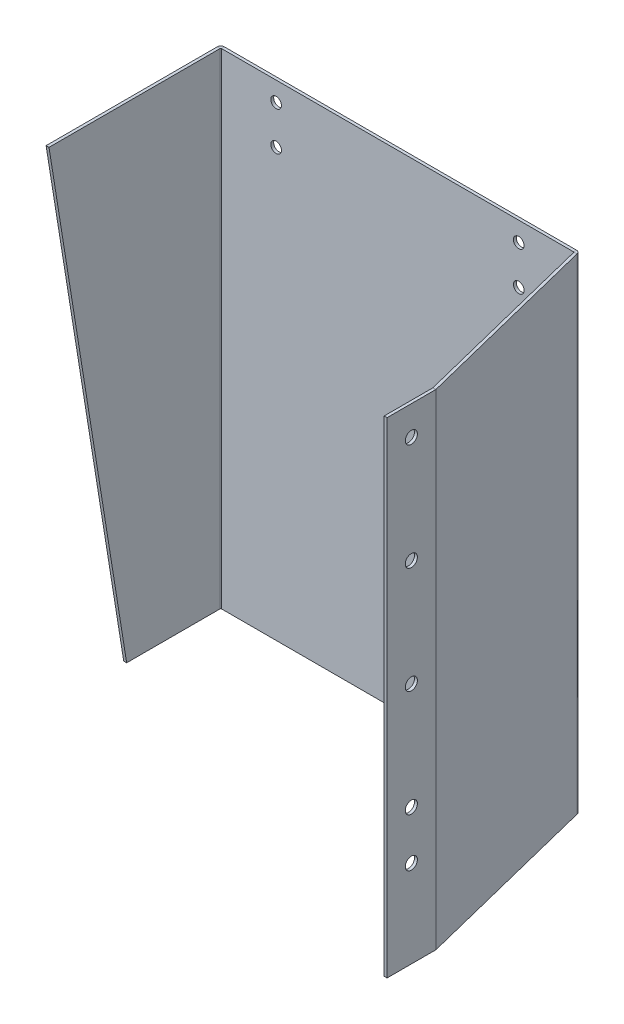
ISO-10303-21;
HEADER;
FILE_DESCRIPTION(('STEP AP214'),'2;1');
FILE_NAME('part.step','',(''),(''),'','','');
FILE_SCHEMA(('AUTOMOTIVE_DESIGN { 1 0 10303 214 1 1 1 1 }'));
ENDSEC;
DATA;
#1=APPLICATION_CONTEXT('core data for automotive mechanical design processes');
#2=APPLICATION_PROTOCOL_DEFINITION('international standard','automotive_design',2000,#1);
#3=PRODUCT_CONTEXT('',#1,'mechanical');
#4=PRODUCT('Part','Part','',(#3));
#5=PRODUCT_RELATED_PRODUCT_CATEGORY('part','',(#4));
#6=PRODUCT_DEFINITION_FORMATION('','',#4);
#7=PRODUCT_DEFINITION_CONTEXT('part definition',#1,'design');
#8=PRODUCT_DEFINITION('design','',#6,#7);
#9=PRODUCT_DEFINITION_SHAPE('','',#8);
#10=(LENGTH_UNIT() NAMED_UNIT(*) SI_UNIT(.MILLI.,.METRE.));
#11=(NAMED_UNIT(*) PLANE_ANGLE_UNIT() SI_UNIT($,.RADIAN.));
#12=(NAMED_UNIT(*) SI_UNIT($,.STERADIAN.) SOLID_ANGLE_UNIT());
#13=UNCERTAINTY_MEASURE_WITH_UNIT(LENGTH_MEASURE(1.E-05),#10,'distance_accuracy_value','');
#14=(GEOMETRIC_REPRESENTATION_CONTEXT(3) GLOBAL_UNCERTAINTY_ASSIGNED_CONTEXT((#13)) GLOBAL_UNIT_ASSIGNED_CONTEXT((#10,
#11,#12)) REPRESENTATION_CONTEXT('',''));
#15=CARTESIAN_POINT('',(0.,0.,0.));
#16=DIRECTION('',(0.,0.,1.));
#17=DIRECTION('',(1.,0.,0.));
#18=AXIS2_PLACEMENT_3D('',#15,#16,#17);
#19=CARTESIAN_POINT('',(366.910887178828,-500.,2.27423431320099));
#20=DIRECTION('',(0.,1.,0.));
#21=DIRECTION('',(-1.,0.,0.));
#22=AXIS2_PLACEMENT_3D('',#19,#20,#21);
#23=PLANE('',#22);
#24=DIRECTION('',(0.970295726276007,0.,-0.241921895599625));
#25=VECTOR('',#24,1.);
#26=CARTESIAN_POINT('',(412.362498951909,-500.,196.971388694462));
#27=LINE('',#26,#25);
#28=CARTESIAN_POINT('',(412.362498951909,-500.,196.971388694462));
#29=VERTEX_POINT('',#28);
#30=CARTESIAN_POINT('',(415.273386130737,-500.,196.245623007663));
#31=VERTEX_POINT('',#30);
#32=EDGE_CURVE('E219',#29,#31,#27,.T.);
#33=ORIENTED_EDGE('',*,*,#32,.F.);
#34=DIRECTION('',(-0.241921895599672,0.,-0.970295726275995));
#35=VECTOR('',#34,1.);
#36=CARTESIAN_POINT('',(364.,-500.,3.));
#37=LINE('',#36,#35);
#38=CARTESIAN_POINT('',(364.13922483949,-500.,3.55840033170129));
#39=VERTEX_POINT('',#38);
#40=EDGE_CURVE('E235',#29,#39,#37,.T.);
#41=ORIENTED_EDGE('',*,*,#40,.T.);
#42=DIRECTION('',(0.970295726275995,0.,-0.241921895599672));
#43=VECTOR('',#42,1.);
#44=CARTESIAN_POINT('',(364.13922483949,-500.,3.55840033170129));
#45=LINE('',#44,#43);
#46=CARTESIAN_POINT('',(367.050112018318,-500.,2.83263464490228));
#47=VERTEX_POINT('',#46);
#48=EDGE_CURVE('E222',#39,#47,#45,.T.);
#49=ORIENTED_EDGE('',*,*,#48,.T.);
#50=DIRECTION('',(-0.241921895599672,0.,-0.970295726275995));
#51=VECTOR('',#50,1.);
#52=CARTESIAN_POINT('',(366.910887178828,-500.,2.27423431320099));
#53=LINE('',#52,#51);
#54=EDGE_CURVE('E239',#31,#47,#53,.T.);
#55=ORIENTED_EDGE('',*,*,#54,.F.);
#56=EDGE_LOOP('',(#33,#41,#49,#55));
#57=FACE_BOUND('',#56,.T.);
#58=ADVANCED_FACE('F43',(#57),#23,.F.);
#59=CARTESIAN_POINT('',(415.295266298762,0.,196.3333795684));
#60=DIRECTION('',(0.,-1.,0.));
#61=DIRECTION('',(0.,0.,-1.));
#62=AXIS2_PLACEMENT_3D('',#59,#60,#61);
#63=PLANE('',#62);
#64=DIRECTION('',(0.970295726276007,0.,-0.241921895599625));
#65=VECTOR('',#64,1.);
#66=CARTESIAN_POINT('',(412.362498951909,0.,196.971388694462));
#67=LINE('',#66,#65);
#68=CARTESIAN_POINT('',(412.362498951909,0.,196.971388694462));
#69=VERTEX_POINT('',#68);
#70=CARTESIAN_POINT('',(415.273386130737,0.,196.245623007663));
#71=VERTEX_POINT('',#70);
#72=EDGE_CURVE('E217',#69,#71,#67,.T.);
#73=ORIENTED_EDGE('',*,*,#72,.T.);
#74=DIRECTION('',(0.241921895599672,0.,0.970295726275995));
#75=VECTOR('',#74,1.);
#76=CARTESIAN_POINT('',(415.295266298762,0.,196.3333795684));
#77=LINE('',#76,#75);
#78=CARTESIAN_POINT('',(367.050112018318,0.,2.83263464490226));
#79=VERTEX_POINT('',#78);
#80=EDGE_CURVE('E241',#79,#71,#77,.T.);
#81=ORIENTED_EDGE('',*,*,#80,.F.);
#82=DIRECTION('',(0.970295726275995,0.,-0.241921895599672));
#83=VECTOR('',#82,1.);
#84=CARTESIAN_POINT('',(364.13922483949,0.,3.55840033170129));
#85=LINE('',#84,#83);
#86=CARTESIAN_POINT('',(364.13922483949,0.,3.55840033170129));
#87=VERTEX_POINT('',#86);
#88=EDGE_CURVE('E227',#87,#79,#85,.T.);
#89=ORIENTED_EDGE('',*,*,#88,.F.);
#90=DIRECTION('',(0.241921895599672,0.,0.970295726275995));
#91=VECTOR('',#90,1.);
#92=CARTESIAN_POINT('',(412.384379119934,0.,197.059145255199));
#93=LINE('',#92,#91);
#94=EDGE_CURVE('E237',#87,#69,#93,.T.);
#95=ORIENTED_EDGE('',*,*,#94,.T.);
#96=EDGE_LOOP('',(#73,#81,#89,#95));
#97=FACE_BOUND('',#96,.T.);
#98=ADVANCED_FACE('F375',(#97),#63,.F.);
#99=CARTESIAN_POINT('',(415.295266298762,-500.,196.3333795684));
#100=DIRECTION('',(-0.970295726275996,0.,0.241921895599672));
#101=DIRECTION('',(0.241921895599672,0.,0.970295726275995));
#102=AXIS2_PLACEMENT_3D('',#99,#100,#101);
#103=PLANE('',#102);
#104=DIRECTION('',(0.,1.,0.));
#105=VECTOR('',#104,1.);
#106=CARTESIAN_POINT('',(415.273386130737,0.,196.245623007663));
#107=LINE('',#106,#105);
#108=EDGE_CURVE('E167',#71,#31,#107,.F.);
#109=ORIENTED_EDGE('',*,*,#108,.T.);
#110=ORIENTED_EDGE('',*,*,#54,.T.);
#111=DIRECTION('',(0.,-1.,0.));
#112=VECTOR('',#111,1.);
#113=CARTESIAN_POINT('',(367.050112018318,-500.,2.8326346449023));
#114=LINE('',#113,#112);
#115=EDGE_CURVE('E230',#79,#47,#114,.T.);
#116=ORIENTED_EDGE('',*,*,#115,.F.);
#117=ORIENTED_EDGE('',*,*,#80,.T.);
#118=EDGE_LOOP('',(#109,#110,#116,#117));
#119=FACE_BOUND('',#118,.T.);
#120=ADVANCED_FACE('F382',(#119),#103,.F.);
#121=CARTESIAN_POINT('',(412.384379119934,-500.,197.059145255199));
#122=DIRECTION('',(-0.970295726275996,0.,0.241921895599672));
#123=DIRECTION('',(0.241921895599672,0.,0.970295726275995));
#124=AXIS2_PLACEMENT_3D('',#121,#122,#123);
#125=PLANE('',#124);
#126=ORIENTED_EDGE('',*,*,#40,.F.);
#127=DIRECTION('',(0.,1.,0.));
#128=VECTOR('',#127,1.);
#129=CARTESIAN_POINT('',(412.362498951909,0.,196.971388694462));
#130=LINE('',#129,#128);
#131=EDGE_CURVE('E58',#69,#29,#130,.F.);
#132=ORIENTED_EDGE('',*,*,#131,.F.);
#133=ORIENTED_EDGE('',*,*,#94,.F.);
#134=DIRECTION('',(0.,1.,0.));
#135=VECTOR('',#134,1.);
#136=CARTESIAN_POINT('',(364.13922483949,-500.,3.55840033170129));
#137=LINE('',#136,#135);
#138=EDGE_CURVE('E225',#39,#87,#137,.T.);
#139=ORIENTED_EDGE('',*,*,#138,.F.);
#140=EDGE_LOOP('',(#126,#132,#133,#139));
#141=FACE_BOUND('',#140,.T.);
#142=ADVANCED_FACE('F453',(#141),#125,.T.);
#143=CARTESIAN_POINT('',(0.,-500.,3.));
#144=DIRECTION('',(0.,1.,0.));
#145=DIRECTION('',(0.,0.,1.));
#146=AXIS2_PLACEMENT_3D('',#143,#144,#145);
#147=PLANE('',#146);
#148=DIRECTION('',(0.,0.,-1.));
#149=VECTOR('',#148,1.);
#150=CARTESIAN_POINT('',(363.424505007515,-500.,3.));
#151=LINE('',#150,#149);
#152=CARTESIAN_POINT('',(363.424505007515,-500.,3.));
#153=VERTEX_POINT('',#152);
#154=CARTESIAN_POINT('',(363.424505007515,-500.,0.));
#155=VERTEX_POINT('',#154);
#156=EDGE_CURVE('E66',#153,#155,#151,.T.);
#157=ORIENTED_EDGE('',*,*,#156,.F.);
#158=DIRECTION('',(1.,0.,0.));
#159=VECTOR('',#158,1.);
#160=CARTESIAN_POINT('',(0.,-500.,3.));
#161=LINE('',#160,#159);
#162=CARTESIAN_POINT('',(0.736600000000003,-500.,3.));
#163=VERTEX_POINT('',#162);
#164=EDGE_CURVE('E320',#163,#153,#161,.T.);
#165=ORIENTED_EDGE('',*,*,#164,.F.);
#166=DIRECTION('',(0.,0.,-1.));
#167=VECTOR('',#166,1.);
#168=CARTESIAN_POINT('',(0.736600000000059,-500.,3.00000000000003));
#169=LINE('',#168,#167);
#170=CARTESIAN_POINT('',(0.736599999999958,-500.,0.));
#171=VERTEX_POINT('',#170);
#172=EDGE_CURVE('E309',#163,#171,#169,.T.);
#173=ORIENTED_EDGE('',*,*,#172,.T.);
#174=DIRECTION('',(1.,0.,0.));
#175=VECTOR('',#174,1.);
#176=CARTESIAN_POINT('',(0.,-500.,0.));
#177=LINE('',#176,#175);
#178=EDGE_CURVE('E315',#171,#155,#177,.T.);
#179=ORIENTED_EDGE('',*,*,#178,.T.);
#180=EDGE_LOOP('',(#157,#165,#173,#179));
#181=FACE_BOUND('',#180,.T.);
#182=ADVANCED_FACE('F450',(#181),#147,.F.);
#183=CARTESIAN_POINT('',(0.,0.,3.));
#184=DIRECTION('',(0.,-1.,0.));
#185=DIRECTION('',(0.,0.,-1.));
#186=AXIS2_PLACEMENT_3D('',#183,#184,#185);
#187=PLANE('',#186);
#188=DIRECTION('',(0.,0.,-1.));
#189=VECTOR('',#188,1.);
#190=CARTESIAN_POINT('',(363.424505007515,0.,3.));
#191=LINE('',#190,#189);
#192=CARTESIAN_POINT('',(363.424505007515,0.,3.));
#193=VERTEX_POINT('',#192);
#194=CARTESIAN_POINT('',(363.424505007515,0.,0.));
#195=VERTEX_POINT('',#194);
#196=EDGE_CURVE('E258',#193,#195,#191,.T.);
#197=ORIENTED_EDGE('',*,*,#196,.T.);
#198=DIRECTION('',(-1.,0.,0.));
#199=VECTOR('',#198,1.);
#200=CARTESIAN_POINT('',(0.,0.,0.));
#201=LINE('',#200,#199);
#202=CARTESIAN_POINT('',(0.736599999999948,0.,0.));
#203=VERTEX_POINT('',#202);
#204=EDGE_CURVE('E318',#195,#203,#201,.T.);
#205=ORIENTED_EDGE('',*,*,#204,.T.);
#206=DIRECTION('',(0.,0.,-1.));
#207=VECTOR('',#206,1.);
#208=CARTESIAN_POINT('',(0.736599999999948,0.,3.00000000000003));
#209=LINE('',#208,#207);
#210=CARTESIAN_POINT('',(0.736599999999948,0.,3.));
#211=VERTEX_POINT('',#210);
#212=EDGE_CURVE('E312',#211,#203,#209,.T.);
#213=ORIENTED_EDGE('',*,*,#212,.F.);
#214=DIRECTION('',(-1.,0.,0.));
#215=VECTOR('',#214,1.);
#216=CARTESIAN_POINT('',(0.,0.,3.));
#217=LINE('',#216,#215);
#218=EDGE_CURVE('E322',#193,#211,#217,.T.);
#219=ORIENTED_EDGE('',*,*,#218,.F.);
#220=EDGE_LOOP('',(#197,#205,#213,#219));
#221=FACE_BOUND('',#220,.T.);
#222=ADVANCED_FACE('F446',(#221),#187,.F.);
#223=CARTESIAN_POINT('',(0.,-500.,3.));
#224=DIRECTION('',(0.,0.,1.));
#225=DIRECTION('',(1.,0.,0.));
#226=AXIS2_PLACEMENT_3D('',#223,#224,#225);
#227=PLANE('',#226);
#228=CARTESIAN_POINT('',(307.,-60.,3.));
#229=DIRECTION('',(0.,0.,1.));
#230=DIRECTION('',(1.,0.,0.));
#231=AXIS2_PLACEMENT_3D('',#228,#229,#230);
#232=CIRCLE('',#231,5.50000000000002);
#233=CARTESIAN_POINT('',(312.5,-60.,3.));
#234=VERTEX_POINT('',#233);
#235=EDGE_CURVE('E341',#234,#234,#232,.T.);
#236=ORIENTED_EDGE('',*,*,#235,.F.);
#237=EDGE_LOOP('',(#236));
#238=FACE_BOUND('',#237,.T.);
#239=CARTESIAN_POINT('',(307.,-20.,3.));
#240=DIRECTION('',(0.,0.,1.));
#241=DIRECTION('',(1.,0.,0.));
#242=AXIS2_PLACEMENT_3D('',#239,#240,#241);
#243=CIRCLE('',#242,5.50000000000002);
#244=CARTESIAN_POINT('',(312.5,-20.,3.));
#245=VERTEX_POINT('',#244);
#246=EDGE_CURVE('E337',#245,#245,#243,.T.);
#247=ORIENTED_EDGE('',*,*,#246,.F.);
#248=EDGE_LOOP('',(#247));
#249=FACE_BOUND('',#248,.T.);
#250=CARTESIAN_POINT('',(56.9999999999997,-60.,3.));
#251=DIRECTION('',(0.,0.,1.));
#252=DIRECTION('',(1.,0.,0.));
#253=AXIS2_PLACEMENT_3D('',#250,#251,#252);
#254=CIRCLE('',#253,5.5);
#255=CARTESIAN_POINT('',(62.4999999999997,-60.,3.));
#256=VERTEX_POINT('',#255);
#257=EDGE_CURVE('E333',#256,#256,#254,.T.);
#258=ORIENTED_EDGE('',*,*,#257,.F.);
#259=EDGE_LOOP('',(#258));
#260=FACE_BOUND('',#259,.T.);
#261=CARTESIAN_POINT('',(56.9999999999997,-20.,3.));
#262=DIRECTION('',(0.,0.,1.));
#263=DIRECTION('',(1.,0.,0.));
#264=AXIS2_PLACEMENT_3D('',#261,#262,#263);
#265=CIRCLE('',#264,5.5);
#266=CARTESIAN_POINT('',(62.4999999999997,-20.,3.));
#267=VERTEX_POINT('',#266);
#268=EDGE_CURVE('E329',#267,#267,#265,.T.);
#269=ORIENTED_EDGE('',*,*,#268,.F.);
#270=EDGE_LOOP('',(#269));
#271=FACE_BOUND('',#270,.T.);
#272=ORIENTED_EDGE('',*,*,#164,.T.);
#273=DIRECTION('',(0.,1.,0.));
#274=VECTOR('',#273,1.);
#275=CARTESIAN_POINT('',(363.424505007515,0.,3.));
#276=LINE('',#275,#274);
#277=EDGE_CURVE('E248',#193,#153,#276,.F.);
#278=ORIENTED_EDGE('',*,*,#277,.F.);
#279=ORIENTED_EDGE('',*,*,#218,.T.);
#280=DIRECTION('',(0.,-1.,0.));
#281=VECTOR('',#280,1.);
#282=CARTESIAN_POINT('',(0.736600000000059,-500.,3.00000000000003));
#283=LINE('',#282,#281);
#284=EDGE_CURVE('E298',#163,#211,#283,.F.);
#285=ORIENTED_EDGE('',*,*,#284,.F.);
#286=EDGE_LOOP('',(#272,#278,#279,#285));
#287=FACE_BOUND('',#286,.T.);
#288=ADVANCED_FACE('F442',(#238,#249,#260,#271,#287),#227,.T.);
#289=CARTESIAN_POINT('',(0.,-500.,0.));
#290=DIRECTION('',(0.,0.,1.));
#291=DIRECTION('',(1.,0.,0.));
#292=AXIS2_PLACEMENT_3D('',#289,#290,#291);
#293=PLANE('',#292);
#294=CARTESIAN_POINT('',(307.,-60.,0.));
#295=DIRECTION('',(0.,0.,1.));
#296=DIRECTION('',(1.,0.,0.));
#297=AXIS2_PLACEMENT_3D('',#294,#295,#296);
#298=CIRCLE('',#297,5.50000000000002);
#299=CARTESIAN_POINT('',(312.5,-60.,0.));
#300=VERTEX_POINT('',#299);
#301=EDGE_CURVE('E338',#300,#300,#298,.T.);
#302=ORIENTED_EDGE('',*,*,#301,.T.);
#303=EDGE_LOOP('',(#302));
#304=FACE_BOUND('',#303,.T.);
#305=CARTESIAN_POINT('',(307.,-20.,0.));
#306=DIRECTION('',(0.,0.,1.));
#307=DIRECTION('',(1.,0.,0.));
#308=AXIS2_PLACEMENT_3D('',#305,#306,#307);
#309=CIRCLE('',#308,5.50000000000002);
#310=CARTESIAN_POINT('',(312.5,-20.,0.));
#311=VERTEX_POINT('',#310);
#312=EDGE_CURVE('E334',#311,#311,#309,.T.);
#313=ORIENTED_EDGE('',*,*,#312,.T.);
#314=EDGE_LOOP('',(#313));
#315=FACE_BOUND('',#314,.T.);
#316=CARTESIAN_POINT('',(56.9999999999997,-60.,0.));
#317=DIRECTION('',(0.,0.,1.));
#318=DIRECTION('',(1.,0.,0.));
#319=AXIS2_PLACEMENT_3D('',#316,#317,#318);
#320=CIRCLE('',#319,5.5);
#321=CARTESIAN_POINT('',(62.4999999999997,-60.,0.));
#322=VERTEX_POINT('',#321);
#323=EDGE_CURVE('E330',#322,#322,#320,.T.);
#324=ORIENTED_EDGE('',*,*,#323,.T.);
#325=EDGE_LOOP('',(#324));
#326=FACE_BOUND('',#325,.T.);
#327=CARTESIAN_POINT('',(56.9999999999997,-20.,0.));
#328=DIRECTION('',(0.,0.,1.));
#329=DIRECTION('',(1.,0.,0.));
#330=AXIS2_PLACEMENT_3D('',#327,#328,#329);
#331=CIRCLE('',#330,5.5);
#332=CARTESIAN_POINT('',(62.4999999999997,-20.,0.));
#333=VERTEX_POINT('',#332);
#334=EDGE_CURVE('E325',#333,#333,#331,.T.);
#335=ORIENTED_EDGE('',*,*,#334,.T.);
#336=EDGE_LOOP('',(#335));
#337=FACE_BOUND('',#336,.T.);
#338=DIRECTION('',(0.,1.,0.));
#339=VECTOR('',#338,1.);
#340=CARTESIAN_POINT('',(363.424505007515,0.,0.));
#341=LINE('',#340,#339);
#342=EDGE_CURVE('E253',#195,#155,#341,.F.);
#343=ORIENTED_EDGE('',*,*,#342,.T.);
#344=ORIENTED_EDGE('',*,*,#178,.F.);
#345=DIRECTION('',(0.,-1.,0.));
#346=VECTOR('',#345,1.);
#347=CARTESIAN_POINT('',(0.736599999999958,-500.,0.));
#348=LINE('',#347,#346);
#349=EDGE_CURVE('E303',#171,#203,#348,.F.);
#350=ORIENTED_EDGE('',*,*,#349,.T.);
#351=ORIENTED_EDGE('',*,*,#204,.F.);
#352=EDGE_LOOP('',(#343,#344,#350,#351));
#353=FACE_BOUND('',#352,.T.);
#354=ADVANCED_FACE('F435',(#304,#315,#326,#337,#353),#293,.F.);
#355=CARTESIAN_POINT('',(0.736599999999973,0.,3.73660000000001));
#356=DIRECTION('',(0.,1.,0.));
#357=DIRECTION('',(-1.,0.,0.));
#358=AXIS2_PLACEMENT_3D('',#355,#356,#357);
#359=PLANE('',#358);
#360=DIRECTION('',(-1.,0.,0.));
#361=VECTOR('',#360,1.);
#362=CARTESIAN_POINT('',(0.,0.,3.7366));
#363=LINE('',#362,#361);
#364=CARTESIAN_POINT('',(0.,0.,3.73660000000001));
#365=VERTEX_POINT('',#364);
#366=CARTESIAN_POINT('',(-3.,0.,3.7366));
#367=VERTEX_POINT('',#366);
#368=EDGE_CURVE('E262',#365,#367,#363,.T.);
#369=ORIENTED_EDGE('',*,*,#368,.F.);
#370=CARTESIAN_POINT('',(0.736599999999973,0.,3.73660000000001));
#371=DIRECTION('',(0.,-1.,0.));
#372=DIRECTION('',(1.,0.,0.));
#373=AXIS2_PLACEMENT_3D('',#370,#371,#372);
#374=CIRCLE('',#373,0.736599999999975);
#375=EDGE_CURVE('E294',#211,#365,#374,.F.);
#376=ORIENTED_EDGE('',*,*,#375,.F.);
#377=ORIENTED_EDGE('',*,*,#212,.T.);
#378=CARTESIAN_POINT('',(0.736599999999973,0.,3.73660000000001));
#379=DIRECTION('',(0.,-1.,0.));
#380=DIRECTION('',(1.,0.,0.));
#381=AXIS2_PLACEMENT_3D('',#378,#379,#380);
#382=CIRCLE('',#381,3.73659999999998);
#383=EDGE_CURVE('E306',#203,#367,#382,.F.);
#384=ORIENTED_EDGE('',*,*,#383,.T.);
#385=EDGE_LOOP('',(#369,#376,#377,#384));
#386=FACE_BOUND('',#385,.T.);
#387=ADVANCED_FACE('F432',(#386),#359,.T.);
#388=CARTESIAN_POINT('',(0.736600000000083,-500.,3.73660000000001));
#389=DIRECTION('',(0.,1.,0.));
#390=DIRECTION('',(-1.,0.,0.));
#391=AXIS2_PLACEMENT_3D('',#388,#389,#390);
#392=PLANE('',#391);
#393=CARTESIAN_POINT('',(0.736600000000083,-500.,3.73660000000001));
#394=DIRECTION('',(0.,-1.,0.));
#395=DIRECTION('',(1.,0.,0.));
#396=AXIS2_PLACEMENT_3D('',#393,#394,#395);
#397=CIRCLE('',#396,0.736599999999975);
#398=CARTESIAN_POINT('',(1.07878116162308E-13,-500.,3.73660000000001));
#399=VERTEX_POINT('',#398);
#400=EDGE_CURVE('E293',#399,#163,#397,.T.);
#401=ORIENTED_EDGE('',*,*,#400,.F.);
#402=DIRECTION('',(-1.,0.,0.));
#403=VECTOR('',#402,1.);
#404=CARTESIAN_POINT('',(0.,-500.,3.73660000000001));
#405=LINE('',#404,#403);
#406=CARTESIAN_POINT('',(-2.99999999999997,-500.,3.7366));
#407=VERTEX_POINT('',#406);
#408=EDGE_CURVE('E266',#399,#407,#405,.T.);
#409=ORIENTED_EDGE('',*,*,#408,.T.);
#410=CARTESIAN_POINT('',(0.736600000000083,-500.,3.73660000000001));
#411=DIRECTION('',(0.,-1.,0.));
#412=DIRECTION('',(1.,0.,0.));
#413=AXIS2_PLACEMENT_3D('',#410,#411,#412);
#414=CIRCLE('',#413,3.73659999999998);
#415=EDGE_CURVE('E297',#407,#171,#414,.T.);
#416=ORIENTED_EDGE('',*,*,#415,.T.);
#417=ORIENTED_EDGE('',*,*,#172,.F.);
#418=EDGE_LOOP('',(#401,#409,#416,#417));
#419=FACE_BOUND('',#418,.T.);
#420=ADVANCED_FACE('F428',(#419),#392,.F.);
#421=CARTESIAN_POINT('',(0.736600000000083,-500.,3.73660000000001));
#422=DIRECTION('',(0.,-1.,0.));
#423=DIRECTION('',(-1.,0.,0.));
#424=AXIS2_PLACEMENT_3D('',#421,#422,#423);
#425=CYLINDRICAL_SURFACE('',#424,3.73659999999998);
#426=ORIENTED_EDGE('',*,*,#349,.F.);
#427=ORIENTED_EDGE('',*,*,#415,.F.);
#428=DIRECTION('',(0.,1.,0.));
#429=VECTOR('',#428,1.);
#430=CARTESIAN_POINT('',(-3.,0.,3.73659999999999));
#431=LINE('',#430,#429);
#432=EDGE_CURVE('E269',#407,#367,#431,.T.);
#433=ORIENTED_EDGE('',*,*,#432,.T.);
#434=ORIENTED_EDGE('',*,*,#383,.F.);
#435=EDGE_LOOP('',(#426,#427,#433,#434));
#436=FACE_BOUND('',#435,.T.);
#437=ADVANCED_FACE('F426',(#436),#425,.T.);
#438=CARTESIAN_POINT('',(0.736600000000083,-500.,3.73660000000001));
#439=DIRECTION('',(0.,-1.,0.));
#440=DIRECTION('',(-1.,0.,0.));
#441=AXIS2_PLACEMENT_3D('',#438,#439,#440);
#442=CYLINDRICAL_SURFACE('',#441,0.736599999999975);
#443=ORIENTED_EDGE('',*,*,#284,.T.);
#444=ORIENTED_EDGE('',*,*,#375,.T.);
#445=DIRECTION('',(0.,-1.,0.));
#446=VECTOR('',#445,1.);
#447=CARTESIAN_POINT('',(0.,0.,3.7366));
#448=LINE('',#447,#446);
#449=EDGE_CURVE('E264',#365,#399,#448,.T.);
#450=ORIENTED_EDGE('',*,*,#449,.T.);
#451=ORIENTED_EDGE('',*,*,#400,.T.);
#452=EDGE_LOOP('',(#443,#444,#450,#451));
#453=FACE_BOUND('',#452,.T.);
#454=ADVANCED_FACE('F422',(#453),#442,.F.);
#455=CARTESIAN_POINT('',(-3.,0.,2.99999999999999));
#456=DIRECTION('',(0.,-1.,0.));
#457=DIRECTION('',(1.,0.,0.));
#458=AXIS2_PLACEMENT_3D('',#455,#456,#457);
#459=PLANE('',#458);
#460=ORIENTED_EDGE('',*,*,#368,.T.);
#461=DIRECTION('',(0.,0.,-1.));
#462=VECTOR('',#461,1.);
#463=CARTESIAN_POINT('',(-3.,0.,2.99999999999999));
#464=LINE('',#463,#462);
#465=CARTESIAN_POINT('',(-3.00000000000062,0.,180.));
#466=VERTEX_POINT('',#465);
#467=EDGE_CURVE('E280',#466,#367,#464,.T.);
#468=ORIENTED_EDGE('',*,*,#467,.F.);
#469=DIRECTION('',(1.,0.,0.));
#470=VECTOR('',#469,1.);
#471=CARTESIAN_POINT('',(-3.00000000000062,0.,180.));
#472=LINE('',#471,#470);
#473=CARTESIAN_POINT('',(-6.17992554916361E-13,0.,180.));
#474=VERTEX_POINT('',#473);
#475=EDGE_CURVE('E287',#466,#474,#472,.T.);
#476=ORIENTED_EDGE('',*,*,#475,.T.);
#477=DIRECTION('',(0.,0.,-1.));
#478=VECTOR('',#477,1.);
#479=CARTESIAN_POINT('',(0.,0.,3.));
#480=LINE('',#479,#478);
#481=EDGE_CURVE('E273',#474,#365,#480,.T.);
#482=ORIENTED_EDGE('',*,*,#481,.T.);
#483=EDGE_LOOP('',(#460,#468,#476,#482));
#484=FACE_BOUND('',#483,.T.);
#485=ADVANCED_FACE('F418',(#484),#459,.F.);
#486=CARTESIAN_POINT('',(-3.00000000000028,-500.,100.));
#487=DIRECTION('',(0.,1.,0.));
#488=DIRECTION('',(-1.,0.,0.));
#489=AXIS2_PLACEMENT_3D('',#486,#487,#488);
#490=PLANE('',#489);
#491=ORIENTED_EDGE('',*,*,#408,.F.);
#492=DIRECTION('',(0.,0.,1.));
#493=VECTOR('',#492,1.);
#494=CARTESIAN_POINT('',(-2.77443568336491E-13,-500.,100.));
#495=LINE('',#494,#493);
#496=CARTESIAN_POINT('',(-2.77443568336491E-13,-500.,100.));
#497=VERTEX_POINT('',#496);
#498=EDGE_CURVE('E276',#399,#497,#495,.T.);
#499=ORIENTED_EDGE('',*,*,#498,.T.);
#500=DIRECTION('',(1.,0.,0.));
#501=VECTOR('',#500,1.);
#502=CARTESIAN_POINT('',(-3.00000000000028,-500.,100.));
#503=LINE('',#502,#501);
#504=CARTESIAN_POINT('',(-3.00000000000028,-500.,100.));
#505=VERTEX_POINT('',#504);
#506=EDGE_CURVE('E290',#505,#497,#503,.T.);
#507=ORIENTED_EDGE('',*,*,#506,.F.);
#508=DIRECTION('',(0.,0.,1.));
#509=VECTOR('',#508,1.);
#510=CARTESIAN_POINT('',(-3.00000000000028,-500.,100.));
#511=LINE('',#510,#509);
#512=EDGE_CURVE('E283',#407,#505,#511,.T.);
#513=ORIENTED_EDGE('',*,*,#512,.F.);
#514=EDGE_LOOP('',(#491,#499,#507,#513));
#515=FACE_BOUND('',#514,.T.);
#516=ADVANCED_FACE('F411',(#515),#490,.F.);
#517=CARTESIAN_POINT('',(-3.,0.,2.99999999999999));
#518=DIRECTION('',(1.,0.,0.));
#519=DIRECTION('',(0.,0.,-1.));
#520=AXIS2_PLACEMENT_3D('',#517,#518,#519);
#521=PLANE('',#520);
#522=ORIENTED_EDGE('',*,*,#432,.F.);
#523=ORIENTED_EDGE('',*,*,#512,.T.);
#524=DIRECTION('',(0.,0.987440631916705,0.157990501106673));
#525=VECTOR('',#524,1.);
#526=CARTESIAN_POINT('',(-3.00000000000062,0.,180.));
#527=LINE('',#526,#525);
#528=EDGE_CURVE('E285',#505,#466,#527,.T.);
#529=ORIENTED_EDGE('',*,*,#528,.T.);
#530=ORIENTED_EDGE('',*,*,#467,.T.);
#531=EDGE_LOOP('',(#522,#523,#529,#530));
#532=FACE_BOUND('',#531,.T.);
#533=ADVANCED_FACE('F407',(#532),#521,.F.);
#534=CARTESIAN_POINT('',(0.,0.,3.));
#535=DIRECTION('',(1.,0.,0.));
#536=DIRECTION('',(0.,0.,-1.));
#537=AXIS2_PLACEMENT_3D('',#534,#535,#536);
#538=PLANE('',#537);
#539=ORIENTED_EDGE('',*,*,#498,.F.);
#540=ORIENTED_EDGE('',*,*,#449,.F.);
#541=ORIENTED_EDGE('',*,*,#481,.F.);
#542=DIRECTION('',(0.,0.987440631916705,0.157990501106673));
#543=VECTOR('',#542,1.);
#544=CARTESIAN_POINT('',(-6.17992554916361E-13,0.,180.));
#545=LINE('',#544,#543);
#546=EDGE_CURVE('E278',#497,#474,#545,.T.);
#547=ORIENTED_EDGE('',*,*,#546,.F.);
#548=EDGE_LOOP('',(#539,#540,#541,#547));
#549=FACE_BOUND('',#548,.T.);
#550=ADVANCED_FACE('F404',(#549),#538,.T.);
#551=CARTESIAN_POINT('',(-3.00000000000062,0.,180.));
#552=DIRECTION('',(0.,0.157990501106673,-0.987440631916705));
#553=DIRECTION('',(0.,0.987440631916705,0.157990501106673));
#554=AXIS2_PLACEMENT_3D('',#551,#552,#553);
#555=PLANE('',#554);
#556=ORIENTED_EDGE('',*,*,#546,.T.);
#557=ORIENTED_EDGE('',*,*,#475,.F.);
#558=ORIENTED_EDGE('',*,*,#528,.F.);
#559=ORIENTED_EDGE('',*,*,#506,.T.);
#560=EDGE_LOOP('',(#556,#557,#558,#559));
#561=FACE_BOUND('',#560,.T.);
#562=ADVANCED_FACE('F399',(#561),#555,.F.);
#563=CARTESIAN_POINT('',(363.424505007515,-500.,3.73660000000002));
#564=DIRECTION('',(0.,-1.,0.));
#565=DIRECTION('',(0.,0.,-1.));
#566=AXIS2_PLACEMENT_3D('',#563,#564,#565);
#567=PLANE('',#566);
#568=ORIENTED_EDGE('',*,*,#48,.F.);
#569=CARTESIAN_POINT('',(363.424505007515,-500.,3.73660000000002));
#570=DIRECTION('',(0.,1.,0.));
#571=DIRECTION('',(0.,0.,1.));
#572=AXIS2_PLACEMENT_3D('',#569,#570,#571);
#573=CIRCLE('',#572,0.736600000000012);
#574=EDGE_CURVE('E244',#153,#39,#573,.F.);
#575=ORIENTED_EDGE('',*,*,#574,.F.);
#576=ORIENTED_EDGE('',*,*,#156,.T.);
#577=CARTESIAN_POINT('',(363.424505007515,-500.,3.73660000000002));
#578=DIRECTION('',(0.,1.,0.));
#579=DIRECTION('',(0.,0.,1.));
#580=AXIS2_PLACEMENT_3D('',#577,#578,#579);
#581=CIRCLE('',#580,3.73660000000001);
#582=EDGE_CURVE('E255',#155,#47,#581,.F.);
#583=ORIENTED_EDGE('',*,*,#582,.T.);
#584=EDGE_LOOP('',(#568,#575,#576,#583));
#585=FACE_BOUND('',#584,.T.);
#586=ADVANCED_FACE('F396',(#585),#567,.T.);
#587=CARTESIAN_POINT('',(363.424505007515,0.,3.73660000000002));
#588=DIRECTION('',(0.,-1.,0.));
#589=DIRECTION('',(0.,0.,-1.));
#590=AXIS2_PLACEMENT_3D('',#587,#588,#589);
#591=PLANE('',#590);
#592=CARTESIAN_POINT('',(363.424505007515,0.,3.73660000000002));
#593=DIRECTION('',(0.,1.,0.));
#594=DIRECTION('',(0.,0.,1.));
#595=AXIS2_PLACEMENT_3D('',#592,#593,#594);
#596=CIRCLE('',#595,0.736600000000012);
#597=EDGE_CURVE('E243',#87,#193,#596,.T.);
#598=ORIENTED_EDGE('',*,*,#597,.F.);
#599=ORIENTED_EDGE('',*,*,#88,.T.);
#600=CARTESIAN_POINT('',(363.424505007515,0.,3.73660000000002));
#601=DIRECTION('',(0.,1.,0.));
#602=DIRECTION('',(0.,0.,1.));
#603=AXIS2_PLACEMENT_3D('',#600,#601,#602);
#604=CIRCLE('',#603,3.73660000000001);
#605=EDGE_CURVE('E247',#79,#195,#604,.T.);
#606=ORIENTED_EDGE('',*,*,#605,.T.);
#607=ORIENTED_EDGE('',*,*,#196,.F.);
#608=EDGE_LOOP('',(#598,#599,#606,#607));
#609=FACE_BOUND('',#608,.T.);
#610=ADVANCED_FACE('F392',(#609),#591,.F.);
#611=CARTESIAN_POINT('',(363.424505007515,0.,3.73660000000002));
#612=DIRECTION('',(0.,1.,0.));
#613=DIRECTION('',(0.970295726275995,0.,-0.241921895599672));
#614=AXIS2_PLACEMENT_3D('',#611,#612,#613);
#615=CYLINDRICAL_SURFACE('',#614,3.73660000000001);
#616=ORIENTED_EDGE('',*,*,#342,.F.);
#617=ORIENTED_EDGE('',*,*,#605,.F.);
#618=ORIENTED_EDGE('',*,*,#115,.T.);
#619=ORIENTED_EDGE('',*,*,#582,.F.);
#620=EDGE_LOOP('',(#616,#617,#618,#619));
#621=FACE_BOUND('',#620,.T.);
#622=ADVANCED_FACE('F390',(#621),#615,.T.);
#623=CARTESIAN_POINT('',(363.424505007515,0.,3.73660000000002));
#624=DIRECTION('',(0.,1.,0.));
#625=DIRECTION('',(0.970295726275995,0.,-0.241921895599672));
#626=AXIS2_PLACEMENT_3D('',#623,#624,#625);
#627=CYLINDRICAL_SURFACE('',#626,0.736600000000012);
#628=ORIENTED_EDGE('',*,*,#277,.T.);
#629=ORIENTED_EDGE('',*,*,#574,.T.);
#630=ORIENTED_EDGE('',*,*,#138,.T.);
#631=ORIENTED_EDGE('',*,*,#597,.T.);
#632=EDGE_LOOP('',(#628,#629,#630,#631));
#633=FACE_BOUND('',#632,.T.);
#634=ADVANCED_FACE('F387',(#633),#627,.F.);
#635=CARTESIAN_POINT('',(411.647779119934,-500.,197.14958836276));
#636=DIRECTION('',(0.,-1.,0.));
#637=DIRECTION('',(0.,0.,-1.));
#638=AXIS2_PLACEMENT_3D('',#635,#636,#637);
#639=PLANE('',#638);
#640=DIRECTION('',(1.,0.,0.));
#641=VECTOR('',#640,1.);
#642=CARTESIAN_POINT('',(412.384379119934,-500.,197.14958836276));
#643=LINE('',#642,#641);
#644=CARTESIAN_POINT('',(412.384379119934,-500.,197.14958836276));
#645=VERTEX_POINT('',#644);
#646=CARTESIAN_POINT('',(415.384379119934,-500.,197.14958836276));
#647=VERTEX_POINT('',#646);
#648=EDGE_CURVE('E328',#645,#647,#643,.T.);
#649=ORIENTED_EDGE('',*,*,#648,.F.);
#650=CARTESIAN_POINT('',(411.647779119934,-500.,197.14958836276));
#651=DIRECTION('',(0.,1.,0.));
#652=DIRECTION('',(0.,0.,1.));
#653=AXIS2_PLACEMENT_3D('',#650,#651,#652);
#654=CIRCLE('',#653,0.736599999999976);
#655=EDGE_CURVE('E170',#29,#645,#654,.F.);
#656=ORIENTED_EDGE('',*,*,#655,.F.);
#657=ORIENTED_EDGE('',*,*,#32,.T.);
#658=CARTESIAN_POINT('',(411.647779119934,-500.,197.14958836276));
#659=DIRECTION('',(0.,1.,0.));
#660=DIRECTION('',(0.,0.,1.));
#661=AXIS2_PLACEMENT_3D('',#658,#659,#660);
#662=CIRCLE('',#661,3.73659999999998);
#663=EDGE_CURVE('E216',#31,#647,#662,.F.);
#664=ORIENTED_EDGE('',*,*,#663,.T.);
#665=EDGE_LOOP('',(#649,#656,#657,#664));
#666=FACE_BOUND('',#665,.T.);
#667=ADVANCED_FACE('F389',(#666),#639,.T.);
#668=CARTESIAN_POINT('',(411.647779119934,0.,197.14958836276));
#669=DIRECTION('',(0.,-1.,0.));
#670=DIRECTION('',(0.,0.,-1.));
#671=AXIS2_PLACEMENT_3D('',#668,#669,#670);
#672=PLANE('',#671);
#673=CARTESIAN_POINT('',(411.647779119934,0.,197.14958836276));
#674=DIRECTION('',(0.,1.,0.));
#675=DIRECTION('',(0.,0.,1.));
#676=AXIS2_PLACEMENT_3D('',#673,#674,#675);
#677=CIRCLE('',#676,0.736599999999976);
#678=CARTESIAN_POINT('',(412.384379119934,0.,197.14958836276));
#679=VERTEX_POINT('',#678);
#680=EDGE_CURVE('E177',#679,#69,#677,.T.);
#681=ORIENTED_EDGE('',*,*,#680,.F.);
#682=DIRECTION('',(1.,0.,0.));
#683=VECTOR('',#682,1.);
#684=CARTESIAN_POINT('',(412.384379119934,0.,197.14958836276));
#685=LINE('',#684,#683);
#686=CARTESIAN_POINT('',(415.384379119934,0.,197.14958836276));
#687=VERTEX_POINT('',#686);
#688=EDGE_CURVE('E174',#679,#687,#685,.T.);
#689=ORIENTED_EDGE('',*,*,#688,.T.);
#690=CARTESIAN_POINT('',(411.647779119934,0.,197.14958836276));
#691=DIRECTION('',(0.,1.,0.));
#692=DIRECTION('',(0.,0.,1.));
#693=AXIS2_PLACEMENT_3D('',#690,#691,#692);
#694=CIRCLE('',#693,3.73659999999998);
#695=EDGE_CURVE('E160',#687,#71,#694,.T.);
#696=ORIENTED_EDGE('',*,*,#695,.T.);
#697=ORIENTED_EDGE('',*,*,#72,.F.);
#698=EDGE_LOOP('',(#681,#689,#696,#697));
#699=FACE_BOUND('',#698,.T.);
#700=ADVANCED_FACE('F175',(#699),#672,.F.);
#701=CARTESIAN_POINT('',(411.647779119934,0.,197.14958836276));
#702=DIRECTION('',(0.,1.,0.));
#703=DIRECTION('',(1.,0.,0.));
#704=AXIS2_PLACEMENT_3D('',#701,#702,#703);
#705=CYLINDRICAL_SURFACE('',#704,3.73659999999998);
#706=ORIENTED_EDGE('',*,*,#108,.F.);
#707=ORIENTED_EDGE('',*,*,#695,.F.);
#708=DIRECTION('',(0.,-1.,0.));
#709=VECTOR('',#708,1.);
#710=CARTESIAN_POINT('',(415.384379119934,0.,197.14958836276));
#711=LINE('',#710,#709);
#712=EDGE_CURVE('E165',#687,#647,#711,.T.);
#713=ORIENTED_EDGE('',*,*,#712,.T.);
#714=ORIENTED_EDGE('',*,*,#663,.F.);
#715=EDGE_LOOP('',(#706,#707,#713,#714));
#716=FACE_BOUND('',#715,.T.);
#717=ADVANCED_FACE('F162',(#716),#705,.T.);
#718=CARTESIAN_POINT('',(411.647779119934,0.,197.14958836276));
#719=DIRECTION('',(0.,1.,0.));
#720=DIRECTION('',(1.,0.,0.));
#721=AXIS2_PLACEMENT_3D('',#718,#719,#720);
#722=CYLINDRICAL_SURFACE('',#721,0.736599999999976);
#723=ORIENTED_EDGE('',*,*,#131,.T.);
#724=ORIENTED_EDGE('',*,*,#655,.T.);
#725=DIRECTION('',(0.,1.,0.));
#726=VECTOR('',#725,1.);
#727=CARTESIAN_POINT('',(412.384379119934,-500.,197.14958836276));
#728=LINE('',#727,#726);
#729=EDGE_CURVE('E181',#645,#679,#728,.T.);
#730=ORIENTED_EDGE('',*,*,#729,.T.);
#731=ORIENTED_EDGE('',*,*,#680,.T.);
#732=EDGE_LOOP('',(#723,#724,#730,#731));
#733=FACE_BOUND('',#732,.T.);
#734=ADVANCED_FACE('F516',(#733),#722,.F.);
#735=CARTESIAN_POINT('',(415.384379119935,0.,247.059145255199));
#736=DIRECTION('',(0.,-1.,0.));
#737=DIRECTION('',(0.,0.,-1.));
#738=AXIS2_PLACEMENT_3D('',#735,#736,#737);
#739=PLANE('',#738);
#740=ORIENTED_EDGE('',*,*,#688,.F.);
#741=DIRECTION('',(0.,0.,1.));
#742=VECTOR('',#741,1.);
#743=CARTESIAN_POINT('',(412.384379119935,0.,247.059145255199));
#744=LINE('',#743,#742);
#745=CARTESIAN_POINT('',(412.384379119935,0.,247.059145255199));
#746=VERTEX_POINT('',#745);
#747=EDGE_CURVE('E191',#679,#746,#744,.T.);
#748=ORIENTED_EDGE('',*,*,#747,.T.);
#749=DIRECTION('',(-1.,0.,0.));
#750=VECTOR('',#749,1.);
#751=CARTESIAN_POINT('',(415.384379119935,0.,247.059145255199));
#752=LINE('',#751,#750);
#753=CARTESIAN_POINT('',(415.384379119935,0.,247.059145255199));
#754=VERTEX_POINT('',#753);
#755=EDGE_CURVE('E196',#754,#746,#752,.T.);
#756=ORIENTED_EDGE('',*,*,#755,.F.);
#757=DIRECTION('',(0.,0.,1.));
#758=VECTOR('',#757,1.);
#759=CARTESIAN_POINT('',(415.384379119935,0.,247.059145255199));
#760=LINE('',#759,#758);
#761=EDGE_CURVE('E187',#687,#754,#760,.T.);
#762=ORIENTED_EDGE('',*,*,#761,.F.);
#763=EDGE_LOOP('',(#740,#748,#756,#762));
#764=FACE_BOUND('',#763,.T.);
#765=ADVANCED_FACE('F194',(#764),#739,.F.);
#766=CARTESIAN_POINT('',(415.384379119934,-500.,197.059145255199));
#767=DIRECTION('',(0.,1.,0.));
#768=DIRECTION('',(-1.,0.,0.));
#769=AXIS2_PLACEMENT_3D('',#766,#767,#768);
#770=PLANE('',#769);
#771=ORIENTED_EDGE('',*,*,#648,.T.);
#772=DIRECTION('',(0.,0.,-1.));
#773=VECTOR('',#772,1.);
#774=CARTESIAN_POINT('',(415.384379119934,-500.,197.059145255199));
#775=LINE('',#774,#773);
#776=CARTESIAN_POINT('',(415.384379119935,-500.,247.059145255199));
#777=VERTEX_POINT('',#776);
#778=EDGE_CURVE('E190',#777,#647,#775,.T.);
#779=ORIENTED_EDGE('',*,*,#778,.F.);
#780=DIRECTION('',(-1.,0.,0.));
#781=VECTOR('',#780,1.);
#782=CARTESIAN_POINT('',(415.384379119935,-500.,247.059145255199));
#783=LINE('',#782,#781);
#784=CARTESIAN_POINT('',(412.384379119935,-500.,247.059145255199));
#785=VERTEX_POINT('',#784);
#786=EDGE_CURVE('E207',#777,#785,#783,.T.);
#787=ORIENTED_EDGE('',*,*,#786,.T.);
#788=DIRECTION('',(0.,0.,-1.));
#789=VECTOR('',#788,1.);
#790=CARTESIAN_POINT('',(412.384379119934,-500.,197.059145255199));
#791=LINE('',#790,#789);
#792=EDGE_CURVE('E198',#785,#645,#791,.T.);
#793=ORIENTED_EDGE('',*,*,#792,.T.);
#794=EDGE_LOOP('',(#771,#779,#787,#793));
#795=FACE_BOUND('',#794,.T.);
#796=ADVANCED_FACE('F368',(#795),#770,.F.);
#797=CARTESIAN_POINT('',(415.384379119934,0.,197.059145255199));
#798=DIRECTION('',(-1.,0.,0.));
#799=DIRECTION('',(0.,0.,1.));
#800=AXIS2_PLACEMENT_3D('',#797,#798,#799);
#801=PLANE('',#800);
#802=CARTESIAN_POINT('',(415.384379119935,-410.,222.059145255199));
#803=DIRECTION('',(-1.,0.,0.));
#804=DIRECTION('',(0.,0.,1.));
#805=AXIS2_PLACEMENT_3D('',#802,#803,#804);
#806=CIRCLE('',#805,6.25);
#807=CARTESIAN_POINT('',(415.384379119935,-410.,228.309145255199));
#808=VERTEX_POINT('',#807);
#809=EDGE_CURVE('E782',#808,#808,#806,.T.);
#810=ORIENTED_EDGE('',*,*,#809,.T.);
#811=EDGE_LOOP('',(#810));
#812=FACE_BOUND('',#811,.T.);
#813=CARTESIAN_POINT('',(415.384379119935,-140.,222.059145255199));
#814=DIRECTION('',(1.,0.,0.));
#815=DIRECTION('',(0.,0.,-1.));
#816=AXIS2_PLACEMENT_3D('',#813,#814,#815);
#817=CIRCLE('',#816,6.25);
#818=CARTESIAN_POINT('',(415.384379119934,-140.,215.809145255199));
#819=VERTEX_POINT('',#818);
#820=EDGE_CURVE('E785',#819,#819,#817,.T.);
#821=ORIENTED_EDGE('',*,*,#820,.F.);
#822=EDGE_LOOP('',(#821));
#823=FACE_BOUND('',#822,.T.);
#824=CARTESIAN_POINT('',(415.384379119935,-30.,222.059145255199));
#825=DIRECTION('',(1.,0.,0.));
#826=DIRECTION('',(0.,0.,-1.));
#827=AXIS2_PLACEMENT_3D('',#824,#825,#826);
#828=CIRCLE('',#827,6.25);
#829=CARTESIAN_POINT('',(415.384379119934,-30.,215.809145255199));
#830=VERTEX_POINT('',#829);
#831=EDGE_CURVE('E345',#830,#830,#828,.T.);
#832=ORIENTED_EDGE('',*,*,#831,.F.);
#833=EDGE_LOOP('',(#832));
#834=FACE_BOUND('',#833,.T.);
#835=ORIENTED_EDGE('',*,*,#712,.F.);
#836=ORIENTED_EDGE('',*,*,#761,.T.);
#837=DIRECTION('',(0.,-1.,0.));
#838=VECTOR('',#837,1.);
#839=CARTESIAN_POINT('',(415.384379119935,-500.,247.059145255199));
#840=LINE('',#839,#838);
#841=EDGE_CURVE('E197',#754,#777,#840,.T.);
#842=ORIENTED_EDGE('',*,*,#841,.T.);
#843=ORIENTED_EDGE('',*,*,#778,.T.);
#844=EDGE_LOOP('',(#835,#836,#842,#843));
#845=FACE_BOUND('',#844,.T.);
#846=CARTESIAN_POINT('',(415.384379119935,-250.,222.059145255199));
#847=DIRECTION('',(1.,0.,0.));
#848=DIRECTION('',(0.,0.,-1.));
#849=AXIS2_PLACEMENT_3D('',#846,#847,#848);
#850=CIRCLE('',#849,6.25);
#851=CARTESIAN_POINT('',(415.384379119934,-250.,215.809145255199));
#852=VERTEX_POINT('',#851);
#853=EDGE_CURVE('E348',#852,#852,#850,.T.);
#854=ORIENTED_EDGE('',*,*,#853,.F.);
#855=EDGE_LOOP('',(#854));
#856=FACE_BOUND('',#855,.T.);
#857=CARTESIAN_POINT('',(415.384379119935,-360.,222.059145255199));
#858=DIRECTION('',(1.,0.,0.));
#859=DIRECTION('',(0.,0.,-1.));
#860=AXIS2_PLACEMENT_3D('',#857,#858,#859);
#861=CIRCLE('',#860,6.25);
#862=CARTESIAN_POINT('',(415.384379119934,-360.,215.809145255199));
#863=VERTEX_POINT('',#862);
#864=EDGE_CURVE('E11',#863,#863,#861,.T.);
#865=ORIENTED_EDGE('',*,*,#864,.F.);
#866=EDGE_LOOP('',(#865));
#867=FACE_BOUND('',#866,.T.);
#868=ADVANCED_FACE('F185',(#812,#823,#834,#845,#856,#867),#801,.F.);
#869=CARTESIAN_POINT('',(412.384379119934,0.,197.059145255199));
#870=DIRECTION('',(-1.,0.,0.));
#871=DIRECTION('',(0.,0.,1.));
#872=AXIS2_PLACEMENT_3D('',#869,#870,#871);
#873=PLANE('',#872);
#874=CARTESIAN_POINT('',(412.384379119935,-410.,222.059145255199));
#875=DIRECTION('',(-1.,0.,0.));
#876=DIRECTION('',(0.,0.,1.));
#877=AXIS2_PLACEMENT_3D('',#874,#875,#876);
#878=CIRCLE('',#877,6.25);
#879=CARTESIAN_POINT('',(412.384379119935,-410.,228.309145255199));
#880=VERTEX_POINT('',#879);
#881=EDGE_CURVE('E779',#880,#880,#878,.T.);
#882=ORIENTED_EDGE('',*,*,#881,.F.);
#883=EDGE_LOOP('',(#882));
#884=FACE_BOUND('',#883,.T.);
#885=CARTESIAN_POINT('',(412.384379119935,-140.,222.059145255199));
#886=DIRECTION('',(-1.,0.,0.));
#887=DIRECTION('',(0.,0.,1.));
#888=AXIS2_PLACEMENT_3D('',#885,#886,#887);
#889=CIRCLE('',#888,6.25);
#890=CARTESIAN_POINT('',(412.384379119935,-140.,228.309145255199));
#891=VERTEX_POINT('',#890);
#892=EDGE_CURVE('E783',#891,#891,#889,.T.);
#893=ORIENTED_EDGE('',*,*,#892,.F.);
#894=EDGE_LOOP('',(#893));
#895=FACE_BOUND('',#894,.T.);
#896=CARTESIAN_POINT('',(412.384379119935,-30.,222.059145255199));
#897=DIRECTION('',(-1.,0.,0.));
#898=DIRECTION('',(0.,0.,1.));
#899=AXIS2_PLACEMENT_3D('',#896,#897,#898);
#900=CIRCLE('',#899,6.25);
#901=CARTESIAN_POINT('',(412.384379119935,-30.,228.309145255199));
#902=VERTEX_POINT('',#901);
#903=EDGE_CURVE('E342',#902,#902,#900,.T.);
#904=ORIENTED_EDGE('',*,*,#903,.F.);
#905=EDGE_LOOP('',(#904));
#906=FACE_BOUND('',#905,.T.);
#907=ORIENTED_EDGE('',*,*,#747,.F.);
#908=ORIENTED_EDGE('',*,*,#729,.F.);
#909=ORIENTED_EDGE('',*,*,#792,.F.);
#910=DIRECTION('',(0.,-1.,0.));
#911=VECTOR('',#910,1.);
#912=CARTESIAN_POINT('',(412.384379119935,-500.,247.059145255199));
#913=LINE('',#912,#911);
#914=EDGE_CURVE('E202',#746,#785,#913,.T.);
#915=ORIENTED_EDGE('',*,*,#914,.F.);
#916=EDGE_LOOP('',(#907,#908,#909,#915));
#917=FACE_BOUND('',#916,.T.);
#918=CARTESIAN_POINT('',(412.384379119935,-250.,222.059145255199));
#919=DIRECTION('',(-1.,0.,0.));
#920=DIRECTION('',(0.,0.,1.));
#921=AXIS2_PLACEMENT_3D('',#918,#919,#920);
#922=CIRCLE('',#921,6.25);
#923=CARTESIAN_POINT('',(412.384379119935,-250.,228.309145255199));
#924=VERTEX_POINT('',#923);
#925=EDGE_CURVE('E324',#924,#924,#922,.T.);
#926=ORIENTED_EDGE('',*,*,#925,.F.);
#927=EDGE_LOOP('',(#926));
#928=FACE_BOUND('',#927,.T.);
#929=CARTESIAN_POINT('',(412.384379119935,-360.,222.059145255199));
#930=DIRECTION('',(-1.,0.,0.));
#931=DIRECTION('',(0.,0.,1.));
#932=AXIS2_PLACEMENT_3D('',#929,#930,#931);
#933=CIRCLE('',#932,6.25);
#934=CARTESIAN_POINT('',(412.384379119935,-360.,228.309145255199));
#935=VERTEX_POINT('',#934);
#936=EDGE_CURVE('E51',#935,#935,#933,.T.);
#937=ORIENTED_EDGE('',*,*,#936,.F.);
#938=EDGE_LOOP('',(#937));
#939=FACE_BOUND('',#938,.T.);
#940=ADVANCED_FACE('F355',(#884,#895,#906,#917,#928,#939),#873,.T.);
#941=CARTESIAN_POINT('',(415.384379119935,-500.,247.059145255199));
#942=DIRECTION('',(0.,0.,-1.));
#943=DIRECTION('',(-1.,0.,0.));
#944=AXIS2_PLACEMENT_3D('',#941,#942,#943);
#945=PLANE('',#944);
#946=ORIENTED_EDGE('',*,*,#914,.T.);
#947=ORIENTED_EDGE('',*,*,#786,.F.);
#948=ORIENTED_EDGE('',*,*,#841,.F.);
#949=ORIENTED_EDGE('',*,*,#755,.T.);
#950=EDGE_LOOP('',(#946,#947,#948,#949));
#951=FACE_BOUND('',#950,.T.);
#952=ADVANCED_FACE('F357',(#951),#945,.F.);
#953=CARTESIAN_POINT('',(56.9999999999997,-20.,-7.));
#954=DIRECTION('',(0.,0.,1.));
#955=DIRECTION('',(1.,0.,0.));
#956=AXIS2_PLACEMENT_3D('',#953,#954,#955);
#957=CYLINDRICAL_SURFACE('',#956,5.5);
#958=ORIENTED_EDGE('',*,*,#268,.T.);
#959=EDGE_LOOP('',(#958));
#960=FACE_BOUND('',#959,.T.);
#961=ORIENTED_EDGE('',*,*,#334,.F.);
#962=EDGE_LOOP('',(#961));
#963=FACE_BOUND('',#962,.T.);
#964=ADVANCED_FACE('F365',(#960,#963),#957,.F.);
#965=CARTESIAN_POINT('',(56.9999999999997,-60.,-7.));
#966=DIRECTION('',(0.,0.,1.));
#967=DIRECTION('',(1.,0.,0.));
#968=AXIS2_PLACEMENT_3D('',#965,#966,#967);
#969=CYLINDRICAL_SURFACE('',#968,5.5);
#970=ORIENTED_EDGE('',*,*,#257,.T.);
#971=EDGE_LOOP('',(#970));
#972=FACE_BOUND('',#971,.T.);
#973=ORIENTED_EDGE('',*,*,#323,.F.);
#974=EDGE_LOOP('',(#973));
#975=FACE_BOUND('',#974,.T.);
#976=ADVANCED_FACE('F488',(#972,#975),#969,.F.);
#977=CARTESIAN_POINT('',(307.,-20.,-7.));
#978=DIRECTION('',(0.,0.,1.));
#979=DIRECTION('',(1.,0.,0.));
#980=AXIS2_PLACEMENT_3D('',#977,#978,#979);
#981=CYLINDRICAL_SURFACE('',#980,5.50000000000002);
#982=ORIENTED_EDGE('',*,*,#246,.T.);
#983=EDGE_LOOP('',(#982));
#984=FACE_BOUND('',#983,.T.);
#985=ORIENTED_EDGE('',*,*,#312,.F.);
#986=EDGE_LOOP('',(#985));
#987=FACE_BOUND('',#986,.T.);
#988=ADVANCED_FACE('F484',(#984,#987),#981,.F.);
#989=CARTESIAN_POINT('',(307.,-60.,-7.));
#990=DIRECTION('',(0.,0.,1.));
#991=DIRECTION('',(1.,0.,0.));
#992=AXIS2_PLACEMENT_3D('',#989,#990,#991);
#993=CYLINDRICAL_SURFACE('',#992,5.50000000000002);
#994=ORIENTED_EDGE('',*,*,#235,.T.);
#995=EDGE_LOOP('',(#994));
#996=FACE_BOUND('',#995,.T.);
#997=ORIENTED_EDGE('',*,*,#301,.F.);
#998=EDGE_LOOP('',(#997));
#999=FACE_BOUND('',#998,.T.);
#1000=ADVANCED_FACE('F475',(#996,#999),#993,.F.);
#1001=CARTESIAN_POINT('',(405.384379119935,-30.,222.059145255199));
#1002=DIRECTION('',(1.,0.,0.));
#1003=DIRECTION('',(0.,0.,-1.));
#1004=AXIS2_PLACEMENT_3D('',#1001,#1002,#1003);
#1005=CYLINDRICAL_SURFACE('',#1004,6.25);
#1006=ORIENTED_EDGE('',*,*,#903,.T.);
#1007=EDGE_LOOP('',(#1006));
#1008=FACE_BOUND('',#1007,.T.);
#1009=ORIENTED_EDGE('',*,*,#831,.T.);
#1010=EDGE_LOOP('',(#1009));
#1011=FACE_BOUND('',#1010,.T.);
#1012=ADVANCED_FACE('F463',(#1008,#1011),#1005,.F.);
#1013=CARTESIAN_POINT('',(405.384379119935,-140.,222.059145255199));
#1014=DIRECTION('',(1.,0.,0.));
#1015=DIRECTION('',(0.,0.,-1.));
#1016=AXIS2_PLACEMENT_3D('',#1013,#1014,#1015);
#1017=CYLINDRICAL_SURFACE('',#1016,6.25);
#1018=ORIENTED_EDGE('',*,*,#892,.T.);
#1019=EDGE_LOOP('',(#1018));
#1020=FACE_BOUND('',#1019,.T.);
#1021=ORIENTED_EDGE('',*,*,#820,.T.);
#1022=EDGE_LOOP('',(#1021));
#1023=FACE_BOUND('',#1022,.T.);
#1024=ADVANCED_FACE('F456',(#1020,#1023),#1017,.F.);
#1025=CARTESIAN_POINT('',(405.384379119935,-250.,222.059145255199));
#1026=DIRECTION('',(1.,0.,0.));
#1027=DIRECTION('',(0.,0.,-1.));
#1028=AXIS2_PLACEMENT_3D('',#1025,#1026,#1027);
#1029=CYLINDRICAL_SURFACE('',#1028,6.25);
#1030=ORIENTED_EDGE('',*,*,#925,.T.);
#1031=EDGE_LOOP('',(#1030));
#1032=FACE_BOUND('',#1031,.T.);
#1033=ORIENTED_EDGE('',*,*,#853,.T.);
#1034=EDGE_LOOP('',(#1033));
#1035=FACE_BOUND('',#1034,.T.);
#1036=ADVANCED_FACE('F454',(#1032,#1035),#1029,.F.);
#1037=CARTESIAN_POINT('',(405.384379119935,-360.,222.059145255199));
#1038=DIRECTION('',(1.,0.,0.));
#1039=DIRECTION('',(0.,0.,-1.));
#1040=AXIS2_PLACEMENT_3D('',#1037,#1038,#1039);
#1041=CYLINDRICAL_SURFACE('',#1040,6.25);
#1042=ORIENTED_EDGE('',*,*,#936,.T.);
#1043=EDGE_LOOP('',(#1042));
#1044=FACE_BOUND('',#1043,.T.);
#1045=ORIENTED_EDGE('',*,*,#864,.T.);
#1046=EDGE_LOOP('',(#1045));
#1047=FACE_BOUND('',#1046,.T.);
#1048=ADVANCED_FACE('F45',(#1044,#1047),#1041,.F.);
#1049=CARTESIAN_POINT('',(422.384379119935,-410.,222.059145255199));
#1050=DIRECTION('',(-1.,0.,0.));
#1051=DIRECTION('',(0.,0.,1.));
#1052=AXIS2_PLACEMENT_3D('',#1049,#1050,#1051);
#1053=CYLINDRICAL_SURFACE('',#1052,6.25);
#1054=ORIENTED_EDGE('',*,*,#881,.T.);
#1055=EDGE_LOOP('',(#1054));
#1056=FACE_BOUND('',#1055,.T.);
#1057=ORIENTED_EDGE('',*,*,#809,.F.);
#1058=EDGE_LOOP('',(#1057));
#1059=FACE_BOUND('',#1058,.T.);
#1060=ADVANCED_FACE('F462',(#1056,#1059),#1053,.F.);
#1061=CLOSED_SHELL('',(#58,#98,#120,#142,#182,#222,#288,#354,#387,#420,#437,#454,#485,#516,#533,
#550,#562,#586,#610,#622,#634,#667,#700,#717,#734,#765,#796,#868,#940,#952,#964,#976,#988,#1000,
#1012,#1024,#1036,#1048,#1060));
#1062=MANIFOLD_SOLID_BREP('B2',#1061);
#1063=ADVANCED_BREP_SHAPE_REPRESENTATION('',(#18,#1062),#14);
#1064=SHAPE_DEFINITION_REPRESENTATION(#9,#1063);
ENDSEC;
END-ISO-10303-21;
